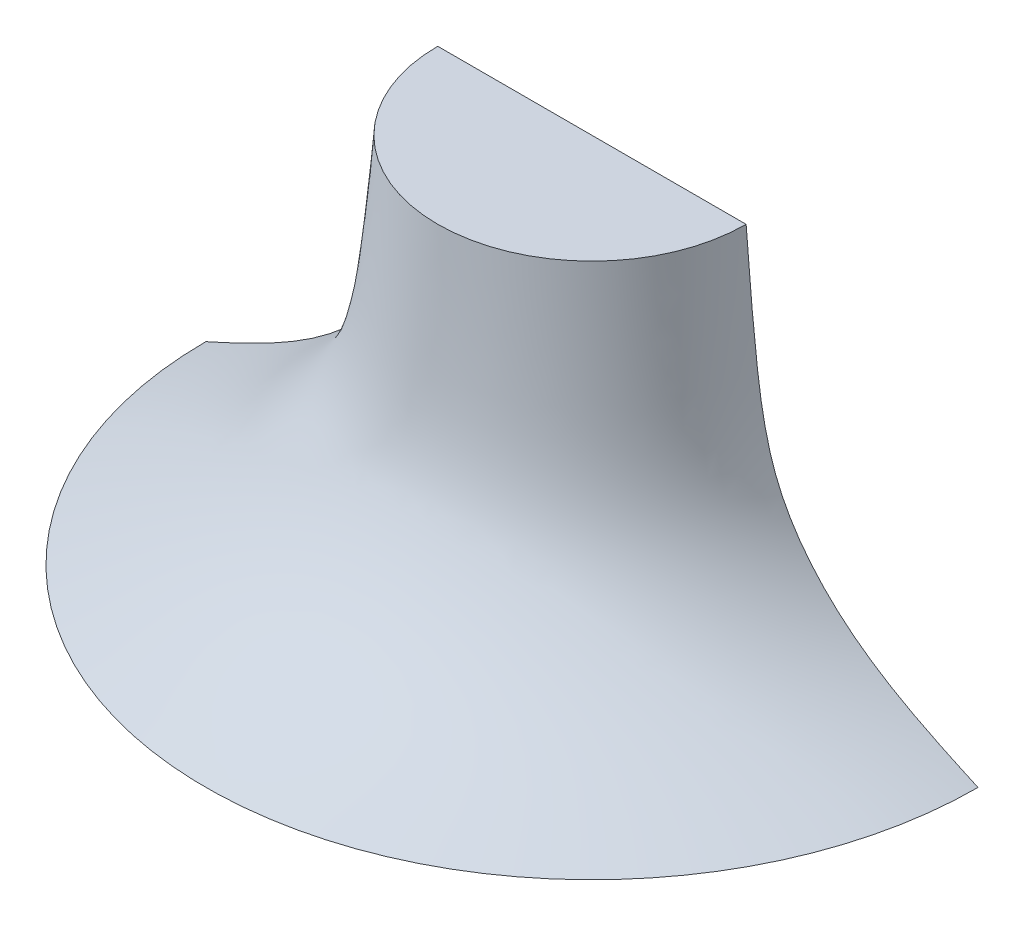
ISO-10303-21;
HEADER;
FILE_DESCRIPTION(('STEP AP214'),'2;1');
FILE_NAME('part.step','',(''),(''),'','','');
FILE_SCHEMA(('AUTOMOTIVE_DESIGN { 1 0 10303 214 1 1 1 1 }'));
ENDSEC;
DATA;
#1=APPLICATION_CONTEXT('core data for automotive mechanical design processes');
#2=APPLICATION_PROTOCOL_DEFINITION('international standard','automotive_design',2000,#1);
#3=PRODUCT_CONTEXT('',#1,'mechanical');
#4=PRODUCT('Part','Part','',(#3));
#5=PRODUCT_RELATED_PRODUCT_CATEGORY('part','',(#4));
#6=PRODUCT_DEFINITION_FORMATION('','',#4);
#7=PRODUCT_DEFINITION_CONTEXT('part definition',#1,'design');
#8=PRODUCT_DEFINITION('design','',#6,#7);
#9=PRODUCT_DEFINITION_SHAPE('','',#8);
#10=(LENGTH_UNIT() NAMED_UNIT(*) SI_UNIT(.MILLI.,.METRE.));
#11=(NAMED_UNIT(*) PLANE_ANGLE_UNIT() SI_UNIT($,.RADIAN.));
#12=(NAMED_UNIT(*) SI_UNIT($,.STERADIAN.) SOLID_ANGLE_UNIT());
#13=UNCERTAINTY_MEASURE_WITH_UNIT(LENGTH_MEASURE(1.E-05),#10,'distance_accuracy_value','');
#14=(GEOMETRIC_REPRESENTATION_CONTEXT(3) GLOBAL_UNCERTAINTY_ASSIGNED_CONTEXT((#13)) GLOBAL_UNIT_ASSIGNED_CONTEXT((#10,
#11,#12)) REPRESENTATION_CONTEXT('',''));
#15=CARTESIAN_POINT('',(0.,0.,0.));
#16=DIRECTION('',(0.,0.,1.));
#17=DIRECTION('',(1.,0.,0.));
#18=AXIS2_PLACEMENT_3D('',#15,#16,#17);
#19=CARTESIAN_POINT('',(29.9119862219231,-40.4870291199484,0.));
#20=DIRECTION('',(0.,-1.,0.));
#21=DIRECTION('',(0.,0.,-1.));
#22=AXIS2_PLACEMENT_3D('',#19,#20,#21);
#23=PLANE('',#22);
#24=CARTESIAN_POINT('',(29.9119862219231,-40.4870291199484,0.));
#25=DIRECTION('',(0.,-1.,0.));
#26=DIRECTION('',(0.,0.,-1.));
#27=AXIS2_PLACEMENT_3D('',#24,#25,#26);
#28=CIRCLE('',#27,85.204152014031);
#29=CARTESIAN_POINT('',(115.116138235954,-40.4870291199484,-5.94977413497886E-13));
#30=VERTEX_POINT('',#29);
#31=CARTESIAN_POINT('',(-55.2921657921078,-40.4870291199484,0.));
#32=VERTEX_POINT('',#31);
#33=EDGE_CURVE('E11',#30,#32,#28,.T.);
#34=ORIENTED_EDGE('',*,*,#33,.F.);
#35=DIRECTION('',(1.,0.,0.));
#36=VECTOR('',#35,1.);
#37=CARTESIAN_POINT('',(29.9119862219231,-40.4870291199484,0.));
#38=LINE('',#37,#36);
#39=EDGE_CURVE('E76',#32,#30,#38,.T.);
#40=ORIENTED_EDGE('',*,*,#39,.F.);
#41=EDGE_LOOP('',(#34,#40));
#42=FACE_BOUND('',#41,.T.);
#43=ADVANCED_FACE('F35',(#42),#23,.F.);
#44=CARTESIAN_POINT('',(115.116138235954,-40.4870291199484,-5.94977413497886E-13));
#45=CARTESIAN_POINT('',(111.104490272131,-38.4922955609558,-5.6696422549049E-13));
#46=CARTESIAN_POINT('',(103.237144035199,-34.2634836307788,-5.1202684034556E-13));
#47=CARTESIAN_POINT('',(92.0755779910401,-26.3490099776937,-4.34086041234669E-13));
#48=CARTESIAN_POINT('',(83.8733947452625,-18.0141790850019,-3.7681050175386E-13));
#49=CARTESIAN_POINT('',(78.5006249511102,-10.4367071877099,-3.39292650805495E-13));
#50=CARTESIAN_POINT('',(75.1930622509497,-4.28924703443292,-3.16196063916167E-13));
#51=CARTESIAN_POINT('',(72.7783335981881,2.1913265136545,-2.99334103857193E-13));
#52=CARTESIAN_POINT('',(70.5029517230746,11.0452199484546,-2.83445197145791E-13));
#53=CARTESIAN_POINT('',(68.9507917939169,22.2951166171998,-2.72606522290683E-13));
#54=CARTESIAN_POINT('',(67.6218578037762,35.4317128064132,-2.63326625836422E-13));
#55=CARTESIAN_POINT('',(66.8928289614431,44.147097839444,-2.58235844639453E-13));
#56=CARTESIAN_POINT('',(66.5436243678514,48.5129708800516,-2.55797361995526E-13));
#57=B_SPLINE_CURVE_WITH_KNOTS('',3,(#44,#45,#46,#47,#48,#49,#50,#51,#52,#53,#54,#55,#56),
.UNSPECIFIED.,.F.,.F.,(4,1,1,1,1,1,1,1,1,1,4),(0.162761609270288,0.257954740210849,
0.353147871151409,0.44834100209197,0.495937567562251,0.543534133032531,0.591130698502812,
0.638727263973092,0.733920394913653,0.829113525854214,0.924306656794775),.UNSPECIFIED.);
#58=CARTESIAN_POINT('',(29.9119862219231,-43.4870291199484,0.));
#59=DIRECTION('',(0.,-1.,0.));
#60=AXIS1_PLACEMENT('',#58,#59);
#61=SURFACE_OF_REVOLUTION('',#57,#60);
#62=CARTESIAN_POINT('',(29.9119862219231,48.5129708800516,0.));
#63=DIRECTION('',(0.,-1.,0.));
#64=DIRECTION('',(0.,0.,-1.));
#65=AXIS2_PLACEMENT_3D('',#62,#63,#64);
#66=CIRCLE('',#65,36.6316381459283);
#67=CARTESIAN_POINT('',(66.5436243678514,48.5129708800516,-2.55797361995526E-13));
#68=VERTEX_POINT('',#67);
#69=CARTESIAN_POINT('',(-6.71965192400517,48.5129708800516,0.));
#70=VERTEX_POINT('',#69);
#71=EDGE_CURVE('E42',#68,#70,#66,.T.);
#72=ORIENTED_EDGE('',*,*,#71,.F.);
#73=EDGE_CURVE('E81',#30,#68,#57,.T.);
#74=ORIENTED_EDGE('',*,*,#73,.F.);
#75=ORIENTED_EDGE('',*,*,#33,.T.);
#76=CARTESIAN_POINT('',(-55.2921657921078,-40.4870291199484,0.));
#77=CARTESIAN_POINT('',(-51.2805178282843,-38.4922955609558,0.));
#78=CARTESIAN_POINT('',(-43.4131715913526,-34.2634836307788,0.));
#79=CARTESIAN_POINT('',(-32.2516055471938,-26.3490099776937,0.));
#80=CARTESIAN_POINT('',(-24.0494223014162,-18.0141790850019,0.));
#81=CARTESIAN_POINT('',(-18.676652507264,-10.4367071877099,0.));
#82=CARTESIAN_POINT('',(-15.3690898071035,-4.28924703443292,0.));
#83=CARTESIAN_POINT('',(-12.9543611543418,2.1913265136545,0.));
#84=CARTESIAN_POINT('',(-10.6789792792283,11.0452199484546,0.));
#85=CARTESIAN_POINT('',(-9.12681935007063,22.2951166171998,0.));
#86=CARTESIAN_POINT('',(-7.79788535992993,35.4317128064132,0.));
#87=CARTESIAN_POINT('',(-7.06885651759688,44.147097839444,0.));
#88=CARTESIAN_POINT('',(-6.71965192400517,48.5129708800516,0.));
#89=B_SPLINE_CURVE_WITH_KNOTS('',3,(#76,#77,#78,#79,#80,#81,#82,#83,#84,#85,#86,#87,#88),
.UNSPECIFIED.,.F.,.F.,(4,1,1,1,1,1,1,1,1,1,4),(0.162761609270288,0.257954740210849,
0.353147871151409,0.44834100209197,0.495937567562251,0.543534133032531,0.591130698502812,
0.638727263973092,0.733920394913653,0.829113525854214,0.924306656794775),.UNSPECIFIED.);
#90=EDGE_CURVE('E87',#32,#70,#89,.T.);
#91=ORIENTED_EDGE('',*,*,#90,.T.);
#92=EDGE_LOOP('',(#72,#74,#75,#91));
#93=FACE_BOUND('',#92,.T.);
#94=ADVANCED_FACE('F86',(#93),#61,.T.);
#95=CARTESIAN_POINT('',(29.9119862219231,48.5129708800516,0.));
#96=DIRECTION('',(0.,1.,0.));
#97=DIRECTION('',(0.,0.,1.));
#98=AXIS2_PLACEMENT_3D('',#95,#96,#97);
#99=PLANE('',#98);
#100=ORIENTED_EDGE('',*,*,#71,.T.);
#101=DIRECTION('',(-1.,0.,0.));
#102=VECTOR('',#101,1.);
#103=CARTESIAN_POINT('',(29.9119862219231,48.5129708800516,0.));
#104=LINE('',#103,#102);
#105=EDGE_CURVE('E91',#68,#70,#104,.T.);
#106=ORIENTED_EDGE('',*,*,#105,.F.);
#107=EDGE_LOOP('',(#100,#106));
#108=FACE_BOUND('',#107,.T.);
#109=ADVANCED_FACE('F116',(#108),#99,.F.);
#110=CARTESIAN_POINT('',(29.9119862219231,51.5129708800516,0.));
#111=DIRECTION('',(0.,-1.,0.));
#112=DIRECTION('',(0.,0.,-1.));
#113=AXIS2_PLACEMENT_3D('',#110,#111,#112);
#114=PLANE('',#113);
#115=CARTESIAN_POINT('',(29.9119862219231,51.5129708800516,0.));
#116=DIRECTION('',(0.,-1.,0.));
#117=DIRECTION('',(0.,0.,-1.));
#118=AXIS2_PLACEMENT_3D('',#115,#116,#117);
#119=CIRCLE('',#118,39.4028817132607);
#120=CARTESIAN_POINT('',(69.3148679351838,51.5129708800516,-2.75148852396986E-13));
#121=VERTEX_POINT('',#120);
#122=CARTESIAN_POINT('',(-9.49089549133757,51.5129708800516,0.));
#123=VERTEX_POINT('',#122);
#124=EDGE_CURVE('E56',#121,#123,#119,.T.);
#125=ORIENTED_EDGE('',*,*,#124,.F.);
#126=DIRECTION('',(1.,0.,0.));
#127=VECTOR('',#126,1.);
#128=CARTESIAN_POINT('',(29.9119862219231,51.5129708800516,0.));
#129=LINE('',#128,#127);
#130=EDGE_CURVE('E135',#123,#121,#129,.T.);
#131=ORIENTED_EDGE('',*,*,#130,.F.);
#132=EDGE_LOOP('',(#125,#131));
#133=FACE_BOUND('',#132,.T.);
#134=ADVANCED_FACE('F119',(#133),#114,.F.);
#135=CARTESIAN_POINT('',(69.3148679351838,51.5129708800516,-2.75148852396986E-13));
#136=CARTESIAN_POINT('',(69.5099523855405,49.0406995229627,-2.76511119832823E-13));
#137=CARTESIAN_POINT('',(70.2421070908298,39.8854867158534,-2.81623728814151E-13));
#138=CARTESIAN_POINT('',(71.93237118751,21.4292097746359,-2.93426779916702E-13));
#139=CARTESIAN_POINT('',(75.7002275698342,-4.27934076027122,-3.19737580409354E-13));
#140=CARTESIAN_POINT('',(95.9474994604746,-27.7117734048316,-4.61123524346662E-13));
#141=CARTESIAN_POINT('',(115.553516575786,-37.5668261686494,-5.98031610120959E-13));
#142=CARTESIAN_POINT('',(127.093407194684,-42.8166143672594,-6.78614235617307E-13));
#143=CARTESIAN_POINT('',(128.571160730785,-43.4870291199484,-6.88933333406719E-13));
#144=B_SPLINE_CURVE_WITH_KNOTS('',3,(#135,#136,#137,#138,#139,#140,#141,#142,#143),
.UNSPECIFIED.,.F.,.F.,(4,1,1,1,1,1,4),(0.066076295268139,0.120006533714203,0.266266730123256,
0.47069565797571,0.669640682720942,0.909190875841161,0.944397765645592),.UNSPECIFIED.);
#145=CARTESIAN_POINT('',(29.9119862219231,-43.4870291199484,0.));
#146=DIRECTION('',(0.,-1.,0.));
#147=AXIS1_PLACEMENT('',#145,#146);
#148=SURFACE_OF_REVOLUTION('',#144,#147);
#149=CARTESIAN_POINT('',(29.9119862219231,-43.4870291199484,0.));
#150=DIRECTION('',(0.,-1.,0.));
#151=DIRECTION('',(0.,0.,-1.));
#152=AXIS2_PLACEMENT_3D('',#149,#150,#151);
#153=CIRCLE('',#152,98.6591745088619);
#154=CARTESIAN_POINT('',(128.571160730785,-43.4870291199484,-6.88933333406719E-13));
#155=VERTEX_POINT('',#154);
#156=CARTESIAN_POINT('',(-68.7471882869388,-43.4870291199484,0.));
#157=VERTEX_POINT('',#156);
#158=EDGE_CURVE('E49',#155,#157,#153,.T.);
#159=ORIENTED_EDGE('',*,*,#158,.F.);
#160=EDGE_CURVE('E129',#121,#155,#144,.T.);
#161=ORIENTED_EDGE('',*,*,#160,.F.);
#162=ORIENTED_EDGE('',*,*,#124,.T.);
#163=CARTESIAN_POINT('',(-9.49089549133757,51.5129708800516,0.));
#164=CARTESIAN_POINT('',(-9.68597994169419,49.0406995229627,0.));
#165=CARTESIAN_POINT('',(-10.4181346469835,39.8854867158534,0.));
#166=CARTESIAN_POINT('',(-12.1083987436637,21.4292097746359,0.));
#167=CARTESIAN_POINT('',(-15.8762551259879,-4.27934076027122,0.));
#168=CARTESIAN_POINT('',(-36.1235270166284,-27.7117734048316,0.));
#169=CARTESIAN_POINT('',(-55.7295441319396,-37.5668261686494,0.));
#170=CARTESIAN_POINT('',(-67.2694347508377,-42.8166143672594,0.));
#171=CARTESIAN_POINT('',(-68.7471882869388,-43.4870291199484,0.));
#172=B_SPLINE_CURVE_WITH_KNOTS('',3,(#163,#164,#165,#166,#167,#168,#169,#170,#171),
.UNSPECIFIED.,.F.,.F.,(4,1,1,1,1,1,4),(0.066076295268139,0.120006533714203,0.266266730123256,
0.47069565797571,0.669640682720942,0.909190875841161,0.944397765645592),.UNSPECIFIED.);
#173=EDGE_CURVE('E82',#123,#157,#172,.T.);
#174=ORIENTED_EDGE('',*,*,#173,.T.);
#175=EDGE_LOOP('',(#159,#161,#162,#174));
#176=FACE_BOUND('',#175,.T.);
#177=ADVANCED_FACE('F123',(#176),#148,.T.);
#178=CARTESIAN_POINT('',(29.9119862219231,-43.4870291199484,0.));
#179=DIRECTION('',(0.,1.,0.));
#180=DIRECTION('',(0.,0.,1.));
#181=AXIS2_PLACEMENT_3D('',#178,#179,#180);
#182=PLANE('',#181);
#183=DIRECTION('',(-1.,0.,0.));
#184=VECTOR('',#183,1.);
#185=CARTESIAN_POINT('',(29.9119862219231,-43.4870291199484,0.));
#186=LINE('',#185,#184);
#187=EDGE_CURVE('E134',#155,#157,#186,.T.);
#188=ORIENTED_EDGE('',*,*,#187,.F.);
#189=ORIENTED_EDGE('',*,*,#158,.T.);
#190=EDGE_LOOP('',(#188,#189));
#191=FACE_BOUND('',#190,.T.);
#192=ADVANCED_FACE('F127',(#191),#182,.F.);
#193=CARTESIAN_POINT('',(75.3418679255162,-4.23372813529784,-3.17235168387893E-13));
#194=DIRECTION('',(0.,0.,-1.));
#195=DIRECTION('',(-1.,0.,0.));
#196=AXIS2_PLACEMENT_3D('',#193,#194,#195);
#197=PLANE('',#196);
#198=ORIENTED_EDGE('',*,*,#90,.F.);
#199=ORIENTED_EDGE('',*,*,#39,.T.);
#200=ORIENTED_EDGE('',*,*,#73,.T.);
#201=ORIENTED_EDGE('',*,*,#105,.T.);
#202=EDGE_LOOP('',(#198,#199,#200,#201));
#203=FACE_BOUND('',#202,.T.);
#204=ORIENTED_EDGE('',*,*,#187,.T.);
#205=ORIENTED_EDGE('',*,*,#173,.F.);
#206=ORIENTED_EDGE('',*,*,#130,.T.);
#207=ORIENTED_EDGE('',*,*,#160,.T.);
#208=EDGE_LOOP('',(#204,#205,#206,#207));
#209=FACE_BOUND('',#208,.T.);
#210=ADVANCED_FACE('F88',(#203,#209),#197,.T.);
#211=CLOSED_SHELL('',(#43,#94,#109,#134,#177,#192,#210));
#212=MANIFOLD_SOLID_BREP('B2',#211);
#213=ADVANCED_BREP_SHAPE_REPRESENTATION('',(#18,#212),#14);
#214=SHAPE_DEFINITION_REPRESENTATION(#9,#213);
ENDSEC;
END-ISO-10303-21;
